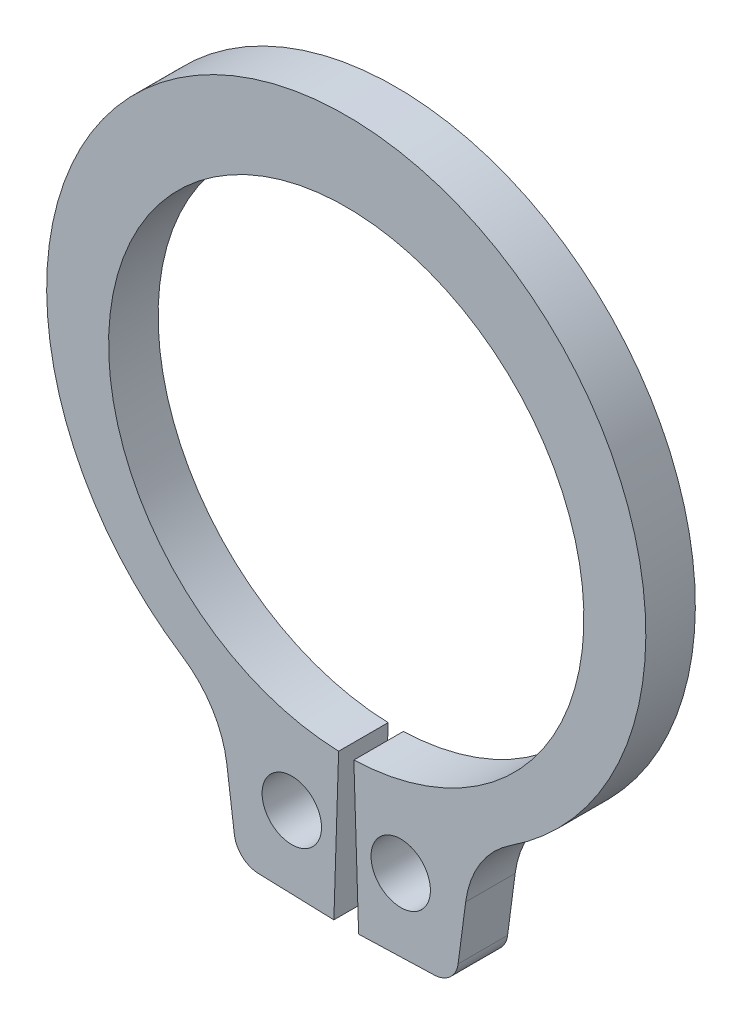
from build123d import *

# Parameters (mm, degrees)
BODYSKE_R  = 0.6
BODY_DEPTH = 1


with BuildPart() as part:
    # BodySke → Body (new body)
    with BuildSketch(Plane.XY):
        with BuildLine():
            Line((0.153846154, -4.797533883), (0.25, -7.79599256))
            Line((0.25, -7.79599256), (1.779245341, -7.746953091))
            ThreePointArc((1.779245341, -7.746953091), (2.098875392, -7.617797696), (2.25894213, -7.312473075))
            Line((2.25894213, -7.312473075), (2.411815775, -6.151282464))
            ThreePointArc((2.411815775, -6.151282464), (2.706754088, -5.332815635), (3.316000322, -4.711771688))
            ThreePointArc((3.316000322, -4.711771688), (0, 6.4), (-3.316000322, -4.711771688))
            ThreePointArc((-3.316000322, -4.711771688), (-2.706754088, -5.332815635), (-2.411815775, -6.151282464))
            Line((-2.411815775, -6.151282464), (-2.25894213, -7.312473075))
            ThreePointArc((-2.25894213, -7.312473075), (-2.098875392, -7.617797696), (-1.779245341, -7.746953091))
            Line((-1.779245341, -7.746953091), (-0.25, -7.79599256))
            Line((-0.25, -7.79599256), (-0.153846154, -4.797533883))
            ThreePointArc((-0.153846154, -4.797533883), (0, 4.8), (0.153846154, -4.797533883))
        make_face()
        with Locations((1.1, -6.304760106)):
            Circle(BODYSKE_R, mode=Mode.SUBTRACT)
        with Locations((-1.1, -6.304760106)):
            Circle(BODYSKE_R, mode=Mode.SUBTRACT)
    extrude(amount=-BODY_DEPTH)


solid = part.part
